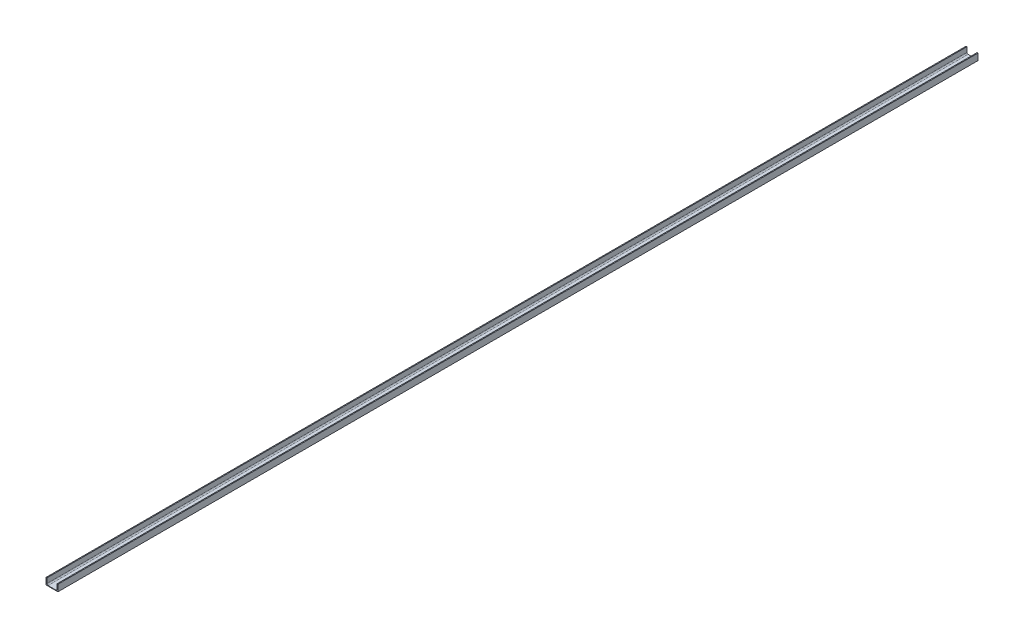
ISO-10303-21;
HEADER;
FILE_DESCRIPTION(('STEP AP214'),'2;1');
FILE_NAME('part.step','',(''),(''),'','','');
FILE_SCHEMA(('AUTOMOTIVE_DESIGN { 1 0 10303 214 1 1 1 1 }'));
ENDSEC;
DATA;
#1=APPLICATION_CONTEXT('core data for automotive mechanical design processes');
#2=APPLICATION_PROTOCOL_DEFINITION('international standard','automotive_design',2000,#1);
#3=PRODUCT_CONTEXT('',#1,'mechanical');
#4=PRODUCT('Part','Part','',(#3));
#5=PRODUCT_RELATED_PRODUCT_CATEGORY('part','',(#4));
#6=PRODUCT_DEFINITION_FORMATION('','',#4);
#7=PRODUCT_DEFINITION_CONTEXT('part definition',#1,'design');
#8=PRODUCT_DEFINITION('design','',#6,#7);
#9=PRODUCT_DEFINITION_SHAPE('','',#8);
#10=(LENGTH_UNIT() NAMED_UNIT(*) SI_UNIT(.MILLI.,.METRE.));
#11=(NAMED_UNIT(*) PLANE_ANGLE_UNIT() SI_UNIT($,.RADIAN.));
#12=(NAMED_UNIT(*) SI_UNIT($,.STERADIAN.) SOLID_ANGLE_UNIT());
#13=UNCERTAINTY_MEASURE_WITH_UNIT(LENGTH_MEASURE(1.E-05),#10,'distance_accuracy_value','');
#14=(GEOMETRIC_REPRESENTATION_CONTEXT(3) GLOBAL_UNCERTAINTY_ASSIGNED_CONTEXT((#13)) GLOBAL_UNIT_ASSIGNED_CONTEXT((#10,
#11,#12)) REPRESENTATION_CONTEXT('',''));
#15=CARTESIAN_POINT('',(0.,0.,0.));
#16=DIRECTION('',(0.,0.,1.));
#17=DIRECTION('',(1.,0.,0.));
#18=AXIS2_PLACEMENT_3D('',#15,#16,#17);
#19=CARTESIAN_POINT('',(0.,0.,7710.));
#20=DIRECTION('',(0.,1.,0.));
#21=DIRECTION('',(0.,0.,1.));
#22=AXIS2_PLACEMENT_3D('',#19,#20,#21);
#23=PLANE('',#22);
#24=CARTESIAN_POINT('',(69.9999999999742,0.,7560.));
#25=DIRECTION('',(0.,-1.,0.));
#26=DIRECTION('',(0.,0.,-1.));
#27=AXIS2_PLACEMENT_3D('',#24,#25,#26);
#28=CIRCLE('',#27,7.5000000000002);
#29=CARTESIAN_POINT('',(69.9999999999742,0.,7552.5));
#30=VERTEX_POINT('',#29);
#31=EDGE_CURVE('E271',#30,#30,#28,.T.);
#32=ORIENTED_EDGE('',*,*,#31,.F.);
#33=EDGE_LOOP('',(#32));
#34=FACE_BOUND('',#33,.T.);
#35=CARTESIAN_POINT('',(69.9999999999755,0.,7170.));
#36=DIRECTION('',(0.,-1.,0.));
#37=DIRECTION('',(0.,0.,-1.));
#38=AXIS2_PLACEMENT_3D('',#35,#36,#37);
#39=CIRCLE('',#38,7.5000000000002);
#40=CARTESIAN_POINT('',(69.9999999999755,0.,7162.5));
#41=VERTEX_POINT('',#40);
#42=EDGE_CURVE('E261',#41,#41,#39,.T.);
#43=ORIENTED_EDGE('',*,*,#42,.F.);
#44=EDGE_LOOP('',(#43));
#45=FACE_BOUND('',#44,.T.);
#46=CARTESIAN_POINT('',(69.9999999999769,0.,6780.));
#47=DIRECTION('',(0.,-1.,0.));
#48=DIRECTION('',(0.,0.,-1.));
#49=AXIS2_PLACEMENT_3D('',#46,#47,#48);
#50=CIRCLE('',#49,7.5000000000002);
#51=CARTESIAN_POINT('',(69.9999999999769,0.,6772.5));
#52=VERTEX_POINT('',#51);
#53=EDGE_CURVE('E258',#52,#52,#50,.T.);
#54=ORIENTED_EDGE('',*,*,#53,.F.);
#55=EDGE_LOOP('',(#54));
#56=FACE_BOUND('',#55,.T.);
#57=CARTESIAN_POINT('',(69.9999999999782,0.,6390.));
#58=DIRECTION('',(0.,-1.,0.));
#59=DIRECTION('',(0.,0.,-1.));
#60=AXIS2_PLACEMENT_3D('',#57,#58,#59);
#61=CIRCLE('',#60,7.5000000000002);
#62=CARTESIAN_POINT('',(69.9999999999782,0.,6382.5));
#63=VERTEX_POINT('',#62);
#64=EDGE_CURVE('E255',#63,#63,#61,.T.);
#65=ORIENTED_EDGE('',*,*,#64,.F.);
#66=EDGE_LOOP('',(#65));
#67=FACE_BOUND('',#66,.T.);
#68=CARTESIAN_POINT('',(69.9999999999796,0.,6000.));
#69=DIRECTION('',(0.,-1.,0.));
#70=DIRECTION('',(0.,0.,-1.));
#71=AXIS2_PLACEMENT_3D('',#68,#69,#70);
#72=CIRCLE('',#71,7.5000000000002);
#73=CARTESIAN_POINT('',(69.9999999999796,0.,5992.5));
#74=VERTEX_POINT('',#73);
#75=EDGE_CURVE('E251',#74,#74,#72,.T.);
#76=ORIENTED_EDGE('',*,*,#75,.F.);
#77=EDGE_LOOP('',(#76));
#78=FACE_BOUND('',#77,.T.);
#79=CARTESIAN_POINT('',(69.999999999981,0.,5610.));
#80=DIRECTION('',(0.,-1.,0.));
#81=DIRECTION('',(0.,0.,-1.));
#82=AXIS2_PLACEMENT_3D('',#79,#80,#81);
#83=CIRCLE('',#82,7.5000000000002);
#84=CARTESIAN_POINT('',(69.999999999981,0.,5602.5));
#85=VERTEX_POINT('',#84);
#86=EDGE_CURVE('E247',#85,#85,#83,.T.);
#87=ORIENTED_EDGE('',*,*,#86,.F.);
#88=EDGE_LOOP('',(#87));
#89=FACE_BOUND('',#88,.T.);
#90=CARTESIAN_POINT('',(69.9999999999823,0.,5220.));
#91=DIRECTION('',(0.,-1.,0.));
#92=DIRECTION('',(0.,0.,-1.));
#93=AXIS2_PLACEMENT_3D('',#90,#91,#92);
#94=CIRCLE('',#93,7.5000000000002);
#95=CARTESIAN_POINT('',(69.9999999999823,0.,5212.5));
#96=VERTEX_POINT('',#95);
#97=EDGE_CURVE('E243',#96,#96,#94,.T.);
#98=ORIENTED_EDGE('',*,*,#97,.F.);
#99=EDGE_LOOP('',(#98));
#100=FACE_BOUND('',#99,.T.);
#101=CARTESIAN_POINT('',(69.9999999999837,0.,4830.));
#102=DIRECTION('',(0.,-1.,0.));
#103=DIRECTION('',(0.,0.,-1.));
#104=AXIS2_PLACEMENT_3D('',#101,#102,#103);
#105=CIRCLE('',#104,7.5000000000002);
#106=CARTESIAN_POINT('',(69.9999999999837,0.,4822.5));
#107=VERTEX_POINT('',#106);
#108=EDGE_CURVE('E239',#107,#107,#105,.T.);
#109=ORIENTED_EDGE('',*,*,#108,.F.);
#110=EDGE_LOOP('',(#109));
#111=FACE_BOUND('',#110,.T.);
#112=CARTESIAN_POINT('',(69.9999999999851,0.,4440.));
#113=DIRECTION('',(0.,-1.,0.));
#114=DIRECTION('',(0.,0.,-1.));
#115=AXIS2_PLACEMENT_3D('',#112,#113,#114);
#116=CIRCLE('',#115,7.5000000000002);
#117=CARTESIAN_POINT('',(69.9999999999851,0.,4432.5));
#118=VERTEX_POINT('',#117);
#119=EDGE_CURVE('E235',#118,#118,#116,.T.);
#120=ORIENTED_EDGE('',*,*,#119,.F.);
#121=EDGE_LOOP('',(#120));
#122=FACE_BOUND('',#121,.T.);
#123=CARTESIAN_POINT('',(69.9999999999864,0.,4050.));
#124=DIRECTION('',(0.,-1.,0.));
#125=DIRECTION('',(0.,0.,-1.));
#126=AXIS2_PLACEMENT_3D('',#123,#124,#125);
#127=CIRCLE('',#126,7.50000000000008);
#128=CARTESIAN_POINT('',(69.9999999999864,0.,4042.5));
#129=VERTEX_POINT('',#128);
#130=EDGE_CURVE('E231',#129,#129,#127,.T.);
#131=ORIENTED_EDGE('',*,*,#130,.F.);
#132=EDGE_LOOP('',(#131));
#133=FACE_BOUND('',#132,.T.);
#134=CARTESIAN_POINT('',(69.9999999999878,0.,3660.));
#135=DIRECTION('',(0.,-1.,0.));
#136=DIRECTION('',(0.,0.,-1.));
#137=AXIS2_PLACEMENT_3D('',#134,#135,#136);
#138=CIRCLE('',#137,7.49999999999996);
#139=CARTESIAN_POINT('',(69.9999999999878,0.,3652.5));
#140=VERTEX_POINT('',#139);
#141=EDGE_CURVE('E227',#140,#140,#138,.T.);
#142=ORIENTED_EDGE('',*,*,#141,.F.);
#143=EDGE_LOOP('',(#142));
#144=FACE_BOUND('',#143,.T.);
#145=CARTESIAN_POINT('',(69.9999999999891,0.,3270.));
#146=DIRECTION('',(0.,-1.,0.));
#147=DIRECTION('',(0.,0.,-1.));
#148=AXIS2_PLACEMENT_3D('',#145,#146,#147);
#149=CIRCLE('',#148,7.49999999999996);
#150=CARTESIAN_POINT('',(69.9999999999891,0.,3262.5));
#151=VERTEX_POINT('',#150);
#152=EDGE_CURVE('E223',#151,#151,#149,.T.);
#153=ORIENTED_EDGE('',*,*,#152,.F.);
#154=EDGE_LOOP('',(#153));
#155=FACE_BOUND('',#154,.T.);
#156=CARTESIAN_POINT('',(69.9999999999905,0.,2880.));
#157=DIRECTION('',(0.,-1.,0.));
#158=DIRECTION('',(0.,0.,-1.));
#159=AXIS2_PLACEMENT_3D('',#156,#157,#158);
#160=CIRCLE('',#159,7.49999999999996);
#161=CARTESIAN_POINT('',(69.9999999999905,0.,2872.5));
#162=VERTEX_POINT('',#161);
#163=EDGE_CURVE('E219',#162,#162,#160,.T.);
#164=ORIENTED_EDGE('',*,*,#163,.F.);
#165=EDGE_LOOP('',(#164));
#166=FACE_BOUND('',#165,.T.);
#167=CARTESIAN_POINT('',(69.9999999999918,0.,2490.));
#168=DIRECTION('',(0.,-1.,0.));
#169=DIRECTION('',(0.,0.,-1.));
#170=AXIS2_PLACEMENT_3D('',#167,#168,#169);
#171=CIRCLE('',#170,7.49999999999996);
#172=CARTESIAN_POINT('',(69.9999999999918,0.,2482.5));
#173=VERTEX_POINT('',#172);
#174=EDGE_CURVE('E215',#173,#173,#171,.T.);
#175=ORIENTED_EDGE('',*,*,#174,.F.);
#176=EDGE_LOOP('',(#175));
#177=FACE_BOUND('',#176,.T.);
#178=CARTESIAN_POINT('',(69.9999999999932,0.,2100.));
#179=DIRECTION('',(0.,-1.,0.));
#180=DIRECTION('',(0.,0.,-1.));
#181=AXIS2_PLACEMENT_3D('',#178,#179,#180);
#182=CIRCLE('',#181,7.49999999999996);
#183=CARTESIAN_POINT('',(69.9999999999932,0.,2092.5));
#184=VERTEX_POINT('',#183);
#185=EDGE_CURVE('E211',#184,#184,#182,.T.);
#186=ORIENTED_EDGE('',*,*,#185,.F.);
#187=EDGE_LOOP('',(#186));
#188=FACE_BOUND('',#187,.T.);
#189=CARTESIAN_POINT('',(69.9999999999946,0.,1710.));
#190=DIRECTION('',(0.,-1.,0.));
#191=DIRECTION('',(0.,0.,-1.));
#192=AXIS2_PLACEMENT_3D('',#189,#190,#191);
#193=CIRCLE('',#192,7.49999999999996);
#194=CARTESIAN_POINT('',(69.9999999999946,0.,1702.5));
#195=VERTEX_POINT('',#194);
#196=EDGE_CURVE('E207',#195,#195,#193,.T.);
#197=ORIENTED_EDGE('',*,*,#196,.F.);
#198=EDGE_LOOP('',(#197));
#199=FACE_BOUND('',#198,.T.);
#200=CARTESIAN_POINT('',(69.9999999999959,0.,1320.));
#201=DIRECTION('',(0.,-1.,0.));
#202=DIRECTION('',(0.,0.,-1.));
#203=AXIS2_PLACEMENT_3D('',#200,#201,#202);
#204=CIRCLE('',#203,7.49999999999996);
#205=CARTESIAN_POINT('',(69.9999999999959,0.,1312.5));
#206=VERTEX_POINT('',#205);
#207=EDGE_CURVE('E203',#206,#206,#204,.T.);
#208=ORIENTED_EDGE('',*,*,#207,.F.);
#209=EDGE_LOOP('',(#208));
#210=FACE_BOUND('',#209,.T.);
#211=CARTESIAN_POINT('',(69.9999999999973,0.,930.));
#212=DIRECTION('',(0.,-1.,0.));
#213=DIRECTION('',(0.,0.,-1.));
#214=AXIS2_PLACEMENT_3D('',#211,#212,#213);
#215=CIRCLE('',#214,7.50000000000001);
#216=CARTESIAN_POINT('',(69.9999999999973,0.,922.5));
#217=VERTEX_POINT('',#216);
#218=EDGE_CURVE('E199',#217,#217,#215,.T.);
#219=ORIENTED_EDGE('',*,*,#218,.F.);
#220=EDGE_LOOP('',(#219));
#221=FACE_BOUND('',#220,.T.);
#222=CARTESIAN_POINT('',(69.9999999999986,0.,540.));
#223=DIRECTION('',(0.,-1.,0.));
#224=DIRECTION('',(0.,0.,-1.));
#225=AXIS2_PLACEMENT_3D('',#222,#223,#224);
#226=CIRCLE('',#225,7.50000000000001);
#227=CARTESIAN_POINT('',(69.9999999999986,0.,532.5));
#228=VERTEX_POINT('',#227);
#229=EDGE_CURVE('E195',#228,#228,#226,.T.);
#230=ORIENTED_EDGE('',*,*,#229,.F.);
#231=EDGE_LOOP('',(#230));
#232=FACE_BOUND('',#231,.T.);
#233=CARTESIAN_POINT('',(70.,0.,150.));
#234=DIRECTION('',(0.,-1.,0.));
#235=DIRECTION('',(0.,0.,-1.));
#236=AXIS2_PLACEMENT_3D('',#233,#234,#235);
#237=CIRCLE('',#236,7.50000000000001);
#238=CARTESIAN_POINT('',(70.,0.,142.5));
#239=VERTEX_POINT('',#238);
#240=EDGE_CURVE('E131',#239,#239,#237,.T.);
#241=ORIENTED_EDGE('',*,*,#240,.F.);
#242=EDGE_LOOP('',(#241));
#243=FACE_BOUND('',#242,.T.);
#244=DIRECTION('',(1.,0.,0.));
#245=VECTOR('',#244,1.);
#246=CARTESIAN_POINT('',(0.,0.,0.));
#247=LINE('',#246,#245);
#248=CARTESIAN_POINT('',(0.,0.,0.));
#249=VERTEX_POINT('',#248);
#250=CARTESIAN_POINT('',(100.,0.,0.));
#251=VERTEX_POINT('',#250);
#252=EDGE_CURVE('E116',#249,#251,#247,.T.);
#253=ORIENTED_EDGE('',*,*,#252,.T.);
#254=DIRECTION('',(0.,0.,-1.));
#255=VECTOR('',#254,1.);
#256=CARTESIAN_POINT('',(100.,0.,7710.));
#257=LINE('',#256,#255);
#258=CARTESIAN_POINT('',(100.,0.,7710.));
#259=VERTEX_POINT('',#258);
#260=EDGE_CURVE('E11',#259,#251,#257,.T.);
#261=ORIENTED_EDGE('',*,*,#260,.F.);
#262=DIRECTION('',(1.,0.,0.));
#263=VECTOR('',#262,1.);
#264=CARTESIAN_POINT('',(0.,0.,7710.));
#265=LINE('',#264,#263);
#266=CARTESIAN_POINT('',(0.,0.,7710.));
#267=VERTEX_POINT('',#266);
#268=EDGE_CURVE('E153',#267,#259,#265,.T.);
#269=ORIENTED_EDGE('',*,*,#268,.F.);
#270=DIRECTION('',(0.,0.,-1.));
#271=VECTOR('',#270,1.);
#272=CARTESIAN_POINT('',(0.,0.,7710.));
#273=LINE('',#272,#271);
#274=EDGE_CURVE('E48',#267,#249,#273,.T.);
#275=ORIENTED_EDGE('',*,*,#274,.T.);
#276=EDGE_LOOP('',(#253,#261,#269,#275));
#277=FACE_BOUND('',#276,.T.);
#278=ADVANCED_FACE('F32',(#34,#45,#56,#67,#78,#89,#100,#111,#122,#133,#144,#155,#166,#177,#188,
#199,#210,#221,#232,#243,#277),#23,.F.);
#279=CARTESIAN_POINT('',(100.,0.,7710.));
#280=DIRECTION('',(-1.,0.,0.));
#281=DIRECTION('',(0.,0.,1.));
#282=AXIS2_PLACEMENT_3D('',#279,#280,#281);
#283=PLANE('',#282);
#284=DIRECTION('',(0.,1.,0.));
#285=VECTOR('',#284,1.);
#286=CARTESIAN_POINT('',(100.,0.,0.));
#287=LINE('',#286,#285);
#288=CARTESIAN_POINT('',(100.,55.,0.));
#289=VERTEX_POINT('',#288);
#290=EDGE_CURVE('E112',#251,#289,#287,.T.);
#291=ORIENTED_EDGE('',*,*,#290,.T.);
#292=DIRECTION('',(0.,0.,-1.));
#293=VECTOR('',#292,1.);
#294=CARTESIAN_POINT('',(100.,55.,7710.));
#295=LINE('',#294,#293);
#296=CARTESIAN_POINT('',(100.,55.,7710.));
#297=VERTEX_POINT('',#296);
#298=EDGE_CURVE('E40',#297,#289,#295,.T.);
#299=ORIENTED_EDGE('',*,*,#298,.F.);
#300=DIRECTION('',(0.,1.,0.));
#301=VECTOR('',#300,1.);
#302=CARTESIAN_POINT('',(100.,0.,7710.));
#303=LINE('',#302,#301);
#304=EDGE_CURVE('E125',#259,#297,#303,.T.);
#305=ORIENTED_EDGE('',*,*,#304,.F.);
#306=ORIENTED_EDGE('',*,*,#260,.T.);
#307=EDGE_LOOP('',(#291,#299,#305,#306));
#308=FACE_BOUND('',#307,.T.);
#309=ADVANCED_FACE('F124',(#308),#283,.F.);
#310=CARTESIAN_POINT('',(100.,55.,7710.));
#311=DIRECTION('',(0.,-1.,0.));
#312=DIRECTION('',(0.,0.,-1.));
#313=AXIS2_PLACEMENT_3D('',#310,#311,#312);
#314=PLANE('',#313);
#315=DIRECTION('',(-1.,0.,0.));
#316=VECTOR('',#315,1.);
#317=CARTESIAN_POINT('',(100.,55.,0.));
#318=LINE('',#317,#316);
#319=CARTESIAN_POINT('',(92.5,55.,0.));
#320=VERTEX_POINT('',#319);
#321=EDGE_CURVE('E118',#289,#320,#318,.T.);
#322=ORIENTED_EDGE('',*,*,#321,.T.);
#323=DIRECTION('',(0.,0.,-1.));
#324=VECTOR('',#323,1.);
#325=CARTESIAN_POINT('',(92.5,55.,7710.));
#326=LINE('',#325,#324);
#327=CARTESIAN_POINT('',(92.5,55.,7710.));
#328=VERTEX_POINT('',#327);
#329=EDGE_CURVE('E188',#328,#320,#326,.T.);
#330=ORIENTED_EDGE('',*,*,#329,.F.);
#331=DIRECTION('',(-1.,0.,0.));
#332=VECTOR('',#331,1.);
#333=CARTESIAN_POINT('',(100.,55.,7710.));
#334=LINE('',#333,#332);
#335=EDGE_CURVE('E156',#297,#328,#334,.T.);
#336=ORIENTED_EDGE('',*,*,#335,.F.);
#337=ORIENTED_EDGE('',*,*,#298,.T.);
#338=EDGE_LOOP('',(#322,#330,#336,#337));
#339=FACE_BOUND('',#338,.T.);
#340=ADVANCED_FACE('F354',(#339),#314,.F.);
#341=CARTESIAN_POINT('',(92.5,55.,7710.));
#342=DIRECTION('',(1.,0.,0.));
#343=DIRECTION('',(0.,0.,-1.));
#344=AXIS2_PLACEMENT_3D('',#341,#342,#343);
#345=PLANE('',#344);
#346=DIRECTION('',(0.,-1.,0.));
#347=VECTOR('',#346,1.);
#348=CARTESIAN_POINT('',(92.5,55.,0.));
#349=LINE('',#348,#347);
#350=CARTESIAN_POINT('',(92.5,14.5000000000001,0.));
#351=VERTEX_POINT('',#350);
#352=EDGE_CURVE('E137',#320,#351,#349,.T.);
#353=ORIENTED_EDGE('',*,*,#352,.T.);
#354=DIRECTION('',(0.,0.,-1.));
#355=VECTOR('',#354,1.);
#356=CARTESIAN_POINT('',(92.5,14.5000000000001,7710.));
#357=LINE('',#356,#355);
#358=CARTESIAN_POINT('',(92.5,14.5000000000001,7710.));
#359=VERTEX_POINT('',#358);
#360=EDGE_CURVE('E185',#359,#351,#357,.T.);
#361=ORIENTED_EDGE('',*,*,#360,.F.);
#362=DIRECTION('',(0.,-1.,0.));
#363=VECTOR('',#362,1.);
#364=CARTESIAN_POINT('',(92.5,55.,7710.));
#365=LINE('',#364,#363);
#366=EDGE_CURVE('E158',#328,#359,#365,.T.);
#367=ORIENTED_EDGE('',*,*,#366,.F.);
#368=ORIENTED_EDGE('',*,*,#329,.T.);
#369=EDGE_LOOP('',(#353,#361,#367,#368));
#370=FACE_BOUND('',#369,.T.);
#371=ADVANCED_FACE('F350',(#370),#345,.F.);
#372=CARTESIAN_POINT('',(82.5,14.5,7710.));
#373=DIRECTION('',(0.,0.,-1.));
#374=DIRECTION('',(-1.,0.,0.));
#375=AXIS2_PLACEMENT_3D('',#372,#373,#374);
#376=CYLINDRICAL_SURFACE('',#375,10.);
#377=CARTESIAN_POINT('',(82.5,14.5,0.));
#378=DIRECTION('',(0.,0.,-1.));
#379=DIRECTION('',(-1.,0.,0.));
#380=AXIS2_PLACEMENT_3D('',#377,#378,#379);
#381=CIRCLE('',#380,10.);
#382=CARTESIAN_POINT('',(82.4999999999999,4.5,0.));
#383=VERTEX_POINT('',#382);
#384=EDGE_CURVE('E139',#351,#383,#381,.T.);
#385=ORIENTED_EDGE('',*,*,#384,.T.);
#386=DIRECTION('',(0.,0.,-1.));
#387=VECTOR('',#386,1.);
#388=CARTESIAN_POINT('',(82.4999999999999,4.5,7710.));
#389=LINE('',#388,#387);
#390=CARTESIAN_POINT('',(82.4999999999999,4.5,7710.));
#391=VERTEX_POINT('',#390);
#392=EDGE_CURVE('E182',#391,#383,#389,.T.);
#393=ORIENTED_EDGE('',*,*,#392,.F.);
#394=CARTESIAN_POINT('',(82.5,14.5,7710.));
#395=DIRECTION('',(0.,0.,-1.));
#396=DIRECTION('',(-1.,0.,0.));
#397=AXIS2_PLACEMENT_3D('',#394,#395,#396);
#398=CIRCLE('',#397,10.);
#399=EDGE_CURVE('E160',#359,#391,#398,.T.);
#400=ORIENTED_EDGE('',*,*,#399,.F.);
#401=ORIENTED_EDGE('',*,*,#360,.T.);
#402=EDGE_LOOP('',(#385,#393,#400,#401));
#403=FACE_BOUND('',#402,.T.);
#404=ADVANCED_FACE('F325',(#403),#376,.F.);
#405=CARTESIAN_POINT('',(82.4999999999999,4.5,7710.));
#406=DIRECTION('',(0.,-1.,0.));
#407=DIRECTION('',(1.,0.,0.));
#408=AXIS2_PLACEMENT_3D('',#405,#406,#407);
#409=PLANE('',#408);
#410=CARTESIAN_POINT('',(69.9999999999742,4.5,7560.));
#411=DIRECTION('',(0.,-1.,0.));
#412=DIRECTION('',(1.,0.,0.));
#413=AXIS2_PLACEMENT_3D('',#410,#411,#412);
#414=CIRCLE('',#413,7.5000000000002);
#415=CARTESIAN_POINT('',(77.4999999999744,4.5,7560.));
#416=VERTEX_POINT('',#415);
#417=EDGE_CURVE('E35',#416,#416,#414,.T.);
#418=ORIENTED_EDGE('',*,*,#417,.T.);
#419=EDGE_LOOP('',(#418));
#420=FACE_BOUND('',#419,.T.);
#421=CARTESIAN_POINT('',(69.9999999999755,4.5,7170.));
#422=DIRECTION('',(0.,-1.,0.));
#423=DIRECTION('',(1.,0.,0.));
#424=AXIS2_PLACEMENT_3D('',#421,#422,#423);
#425=CIRCLE('',#424,7.5000000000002);
#426=CARTESIAN_POINT('',(77.4999999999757,4.5,7170.));
#427=VERTEX_POINT('',#426);
#428=EDGE_CURVE('E259',#427,#427,#425,.T.);
#429=ORIENTED_EDGE('',*,*,#428,.T.);
#430=EDGE_LOOP('',(#429));
#431=FACE_BOUND('',#430,.T.);
#432=CARTESIAN_POINT('',(69.9999999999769,4.5,6780.));
#433=DIRECTION('',(0.,-1.,0.));
#434=DIRECTION('',(1.,0.,0.));
#435=AXIS2_PLACEMENT_3D('',#432,#433,#434);
#436=CIRCLE('',#435,7.5000000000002);
#437=CARTESIAN_POINT('',(77.4999999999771,4.5,6780.));
#438=VERTEX_POINT('',#437);
#439=EDGE_CURVE('E256',#438,#438,#436,.T.);
#440=ORIENTED_EDGE('',*,*,#439,.T.);
#441=EDGE_LOOP('',(#440));
#442=FACE_BOUND('',#441,.T.);
#443=CARTESIAN_POINT('',(69.9999999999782,4.5,6390.));
#444=DIRECTION('',(0.,-1.,0.));
#445=DIRECTION('',(1.,0.,0.));
#446=AXIS2_PLACEMENT_3D('',#443,#444,#445);
#447=CIRCLE('',#446,7.5000000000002);
#448=CARTESIAN_POINT('',(77.4999999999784,4.5,6390.));
#449=VERTEX_POINT('',#448);
#450=EDGE_CURVE('E252',#449,#449,#447,.T.);
#451=ORIENTED_EDGE('',*,*,#450,.T.);
#452=EDGE_LOOP('',(#451));
#453=FACE_BOUND('',#452,.T.);
#454=CARTESIAN_POINT('',(69.9999999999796,4.5,6000.));
#455=DIRECTION('',(0.,-1.,0.));
#456=DIRECTION('',(1.,0.,0.));
#457=AXIS2_PLACEMENT_3D('',#454,#455,#456);
#458=CIRCLE('',#457,7.5000000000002);
#459=CARTESIAN_POINT('',(77.4999999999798,4.5,6000.));
#460=VERTEX_POINT('',#459);
#461=EDGE_CURVE('E248',#460,#460,#458,.T.);
#462=ORIENTED_EDGE('',*,*,#461,.T.);
#463=EDGE_LOOP('',(#462));
#464=FACE_BOUND('',#463,.T.);
#465=CARTESIAN_POINT('',(69.999999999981,4.5,5610.));
#466=DIRECTION('',(0.,-1.,0.));
#467=DIRECTION('',(1.,0.,0.));
#468=AXIS2_PLACEMENT_3D('',#465,#466,#467);
#469=CIRCLE('',#468,7.5000000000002);
#470=CARTESIAN_POINT('',(77.4999999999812,4.5,5610.));
#471=VERTEX_POINT('',#470);
#472=EDGE_CURVE('E244',#471,#471,#469,.T.);
#473=ORIENTED_EDGE('',*,*,#472,.T.);
#474=EDGE_LOOP('',(#473));
#475=FACE_BOUND('',#474,.T.);
#476=CARTESIAN_POINT('',(69.9999999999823,4.5,5220.));
#477=DIRECTION('',(0.,-1.,0.));
#478=DIRECTION('',(1.,0.,0.));
#479=AXIS2_PLACEMENT_3D('',#476,#477,#478);
#480=CIRCLE('',#479,7.5000000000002);
#481=CARTESIAN_POINT('',(77.4999999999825,4.5,5220.));
#482=VERTEX_POINT('',#481);
#483=EDGE_CURVE('E240',#482,#482,#480,.T.);
#484=ORIENTED_EDGE('',*,*,#483,.T.);
#485=EDGE_LOOP('',(#484));
#486=FACE_BOUND('',#485,.T.);
#487=CARTESIAN_POINT('',(69.9999999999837,4.5,4830.));
#488=DIRECTION('',(0.,-1.,0.));
#489=DIRECTION('',(1.,0.,0.));
#490=AXIS2_PLACEMENT_3D('',#487,#488,#489);
#491=CIRCLE('',#490,7.5000000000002);
#492=CARTESIAN_POINT('',(77.4999999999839,4.5,4830.));
#493=VERTEX_POINT('',#492);
#494=EDGE_CURVE('E236',#493,#493,#491,.T.);
#495=ORIENTED_EDGE('',*,*,#494,.T.);
#496=EDGE_LOOP('',(#495));
#497=FACE_BOUND('',#496,.T.);
#498=CARTESIAN_POINT('',(69.9999999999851,4.5,4440.));
#499=DIRECTION('',(0.,-1.,0.));
#500=DIRECTION('',(1.,0.,0.));
#501=AXIS2_PLACEMENT_3D('',#498,#499,#500);
#502=CIRCLE('',#501,7.5000000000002);
#503=CARTESIAN_POINT('',(77.4999999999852,4.5,4440.));
#504=VERTEX_POINT('',#503);
#505=EDGE_CURVE('E232',#504,#504,#502,.T.);
#506=ORIENTED_EDGE('',*,*,#505,.T.);
#507=EDGE_LOOP('',(#506));
#508=FACE_BOUND('',#507,.T.);
#509=CARTESIAN_POINT('',(69.9999999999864,4.5,4050.));
#510=DIRECTION('',(0.,-1.,0.));
#511=DIRECTION('',(1.,0.,0.));
#512=AXIS2_PLACEMENT_3D('',#509,#510,#511);
#513=CIRCLE('',#512,7.50000000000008);
#514=CARTESIAN_POINT('',(77.4999999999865,4.5,4050.));
#515=VERTEX_POINT('',#514);
#516=EDGE_CURVE('E228',#515,#515,#513,.T.);
#517=ORIENTED_EDGE('',*,*,#516,.T.);
#518=EDGE_LOOP('',(#517));
#519=FACE_BOUND('',#518,.T.);
#520=CARTESIAN_POINT('',(69.9999999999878,4.5,3660.));
#521=DIRECTION('',(0.,-1.,0.));
#522=DIRECTION('',(1.,0.,0.));
#523=AXIS2_PLACEMENT_3D('',#520,#521,#522);
#524=CIRCLE('',#523,7.49999999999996);
#525=CARTESIAN_POINT('',(77.4999999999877,4.5,3660.));
#526=VERTEX_POINT('',#525);
#527=EDGE_CURVE('E224',#526,#526,#524,.T.);
#528=ORIENTED_EDGE('',*,*,#527,.T.);
#529=EDGE_LOOP('',(#528));
#530=FACE_BOUND('',#529,.T.);
#531=CARTESIAN_POINT('',(69.9999999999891,4.5,3270.));
#532=DIRECTION('',(0.,-1.,0.));
#533=DIRECTION('',(1.,0.,0.));
#534=AXIS2_PLACEMENT_3D('',#531,#532,#533);
#535=CIRCLE('',#534,7.49999999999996);
#536=CARTESIAN_POINT('',(77.4999999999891,4.5,3270.));
#537=VERTEX_POINT('',#536);
#538=EDGE_CURVE('E220',#537,#537,#535,.T.);
#539=ORIENTED_EDGE('',*,*,#538,.T.);
#540=EDGE_LOOP('',(#539));
#541=FACE_BOUND('',#540,.T.);
#542=CARTESIAN_POINT('',(69.9999999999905,4.5,2880.));
#543=DIRECTION('',(0.,-1.,0.));
#544=DIRECTION('',(1.,0.,0.));
#545=AXIS2_PLACEMENT_3D('',#542,#543,#544);
#546=CIRCLE('',#545,7.49999999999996);
#547=CARTESIAN_POINT('',(77.4999999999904,4.5,2880.));
#548=VERTEX_POINT('',#547);
#549=EDGE_CURVE('E216',#548,#548,#546,.T.);
#550=ORIENTED_EDGE('',*,*,#549,.T.);
#551=EDGE_LOOP('',(#550));
#552=FACE_BOUND('',#551,.T.);
#553=CARTESIAN_POINT('',(69.9999999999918,4.5,2490.));
#554=DIRECTION('',(0.,-1.,0.));
#555=DIRECTION('',(1.,0.,0.));
#556=AXIS2_PLACEMENT_3D('',#553,#554,#555);
#557=CIRCLE('',#556,7.49999999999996);
#558=CARTESIAN_POINT('',(77.4999999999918,4.5,2490.));
#559=VERTEX_POINT('',#558);
#560=EDGE_CURVE('E212',#559,#559,#557,.T.);
#561=ORIENTED_EDGE('',*,*,#560,.T.);
#562=EDGE_LOOP('',(#561));
#563=FACE_BOUND('',#562,.T.);
#564=CARTESIAN_POINT('',(69.9999999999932,4.5,2100.));
#565=DIRECTION('',(0.,-1.,0.));
#566=DIRECTION('',(1.,0.,0.));
#567=AXIS2_PLACEMENT_3D('',#564,#565,#566);
#568=CIRCLE('',#567,7.49999999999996);
#569=CARTESIAN_POINT('',(77.4999999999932,4.5,2100.));
#570=VERTEX_POINT('',#569);
#571=EDGE_CURVE('E208',#570,#570,#568,.T.);
#572=ORIENTED_EDGE('',*,*,#571,.T.);
#573=EDGE_LOOP('',(#572));
#574=FACE_BOUND('',#573,.T.);
#575=CARTESIAN_POINT('',(69.9999999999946,4.5,1710.));
#576=DIRECTION('',(0.,-1.,0.));
#577=DIRECTION('',(1.,0.,0.));
#578=AXIS2_PLACEMENT_3D('',#575,#576,#577);
#579=CIRCLE('',#578,7.49999999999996);
#580=CARTESIAN_POINT('',(77.4999999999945,4.5,1710.));
#581=VERTEX_POINT('',#580);
#582=EDGE_CURVE('E204',#581,#581,#579,.T.);
#583=ORIENTED_EDGE('',*,*,#582,.T.);
#584=EDGE_LOOP('',(#583));
#585=FACE_BOUND('',#584,.T.);
#586=CARTESIAN_POINT('',(69.9999999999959,4.5,1320.));
#587=DIRECTION('',(0.,-1.,0.));
#588=DIRECTION('',(1.,0.,0.));
#589=AXIS2_PLACEMENT_3D('',#586,#587,#588);
#590=CIRCLE('',#589,7.49999999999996);
#591=CARTESIAN_POINT('',(77.4999999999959,4.5,1320.));
#592=VERTEX_POINT('',#591);
#593=EDGE_CURVE('E200',#592,#592,#590,.T.);
#594=ORIENTED_EDGE('',*,*,#593,.T.);
#595=EDGE_LOOP('',(#594));
#596=FACE_BOUND('',#595,.T.);
#597=CARTESIAN_POINT('',(69.9999999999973,4.5,930.));
#598=DIRECTION('',(0.,-1.,0.));
#599=DIRECTION('',(1.,0.,0.));
#600=AXIS2_PLACEMENT_3D('',#597,#598,#599);
#601=CIRCLE('',#600,7.50000000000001);
#602=CARTESIAN_POINT('',(77.4999999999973,4.5,930.));
#603=VERTEX_POINT('',#602);
#604=EDGE_CURVE('E196',#603,#603,#601,.T.);
#605=ORIENTED_EDGE('',*,*,#604,.T.);
#606=EDGE_LOOP('',(#605));
#607=FACE_BOUND('',#606,.T.);
#608=CARTESIAN_POINT('',(69.9999999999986,4.5,540.));
#609=DIRECTION('',(0.,-1.,0.));
#610=DIRECTION('',(1.,0.,0.));
#611=AXIS2_PLACEMENT_3D('',#608,#609,#610);
#612=CIRCLE('',#611,7.50000000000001);
#613=CARTESIAN_POINT('',(77.4999999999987,4.5,540.));
#614=VERTEX_POINT('',#613);
#615=EDGE_CURVE('E192',#614,#614,#612,.T.);
#616=ORIENTED_EDGE('',*,*,#615,.T.);
#617=EDGE_LOOP('',(#616));
#618=FACE_BOUND('',#617,.T.);
#619=CARTESIAN_POINT('',(70.,4.5,150.));
#620=DIRECTION('',(0.,-1.,0.));
#621=DIRECTION('',(1.,0.,0.));
#622=AXIS2_PLACEMENT_3D('',#619,#620,#621);
#623=CIRCLE('',#622,7.50000000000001);
#624=CARTESIAN_POINT('',(77.5,4.5,150.));
#625=VERTEX_POINT('',#624);
#626=EDGE_CURVE('E128',#625,#625,#623,.T.);
#627=ORIENTED_EDGE('',*,*,#626,.T.);
#628=EDGE_LOOP('',(#627));
#629=FACE_BOUND('',#628,.T.);
#630=DIRECTION('',(-1.,0.,0.));
#631=VECTOR('',#630,1.);
#632=CARTESIAN_POINT('',(82.4999999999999,4.5,0.));
#633=LINE('',#632,#631);
#634=CARTESIAN_POINT('',(17.5000000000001,4.49999999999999,0.));
#635=VERTEX_POINT('',#634);
#636=EDGE_CURVE('E141',#383,#635,#633,.T.);
#637=ORIENTED_EDGE('',*,*,#636,.T.);
#638=DIRECTION('',(0.,0.,-1.));
#639=VECTOR('',#638,1.);
#640=CARTESIAN_POINT('',(17.5000000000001,4.49999999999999,7710.));
#641=LINE('',#640,#639);
#642=CARTESIAN_POINT('',(17.5000000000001,4.49999999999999,7710.));
#643=VERTEX_POINT('',#642);
#644=EDGE_CURVE('E179',#643,#635,#641,.T.);
#645=ORIENTED_EDGE('',*,*,#644,.F.);
#646=DIRECTION('',(-1.,0.,0.));
#647=VECTOR('',#646,1.);
#648=CARTESIAN_POINT('',(82.4999999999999,4.5,7710.));
#649=LINE('',#648,#647);
#650=EDGE_CURVE('E162',#391,#643,#649,.T.);
#651=ORIENTED_EDGE('',*,*,#650,.F.);
#652=ORIENTED_EDGE('',*,*,#392,.T.);
#653=EDGE_LOOP('',(#637,#645,#651,#652));
#654=FACE_BOUND('',#653,.T.);
#655=ADVANCED_FACE('F321',(#420,#431,#442,#453,#464,#475,#486,#497,#508,#519,#530,#541,#552,
#563,#574,#585,#596,#607,#618,#629,#654),#409,.F.);
#656=CARTESIAN_POINT('',(17.5,14.5,7710.));
#657=DIRECTION('',(0.,0.,-1.));
#658=DIRECTION('',(-1.,0.,0.));
#659=AXIS2_PLACEMENT_3D('',#656,#657,#658);
#660=CYLINDRICAL_SURFACE('',#659,10.);
#661=CARTESIAN_POINT('',(17.5,14.5,0.));
#662=DIRECTION('',(0.,0.,-1.));
#663=DIRECTION('',(-1.,0.,0.));
#664=AXIS2_PLACEMENT_3D('',#661,#662,#663);
#665=CIRCLE('',#664,10.);
#666=CARTESIAN_POINT('',(7.50000000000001,14.5000000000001,0.));
#667=VERTEX_POINT('',#666);
#668=EDGE_CURVE('E143',#635,#667,#665,.T.);
#669=ORIENTED_EDGE('',*,*,#668,.T.);
#670=DIRECTION('',(0.,0.,-1.));
#671=VECTOR('',#670,1.);
#672=CARTESIAN_POINT('',(7.50000000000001,14.5000000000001,7710.));
#673=LINE('',#672,#671);
#674=CARTESIAN_POINT('',(7.50000000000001,14.5000000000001,7710.));
#675=VERTEX_POINT('',#674);
#676=EDGE_CURVE('E176',#675,#667,#673,.T.);
#677=ORIENTED_EDGE('',*,*,#676,.F.);
#678=CARTESIAN_POINT('',(17.5,14.5,7710.));
#679=DIRECTION('',(0.,0.,-1.));
#680=DIRECTION('',(-1.,0.,0.));
#681=AXIS2_PLACEMENT_3D('',#678,#679,#680);
#682=CIRCLE('',#681,10.);
#683=EDGE_CURVE('E164',#643,#675,#682,.T.);
#684=ORIENTED_EDGE('',*,*,#683,.F.);
#685=ORIENTED_EDGE('',*,*,#644,.T.);
#686=EDGE_LOOP('',(#669,#677,#684,#685));
#687=FACE_BOUND('',#686,.T.);
#688=ADVANCED_FACE('F324',(#687),#660,.F.);
#689=CARTESIAN_POINT('',(7.50000000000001,14.5000000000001,7710.));
#690=DIRECTION('',(-1.,0.,0.));
#691=DIRECTION('',(0.,-1.,0.));
#692=AXIS2_PLACEMENT_3D('',#689,#690,#691);
#693=PLANE('',#692);
#694=DIRECTION('',(0.,1.,0.));
#695=VECTOR('',#694,1.);
#696=CARTESIAN_POINT('',(7.50000000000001,14.5000000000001,0.));
#697=LINE('',#696,#695);
#698=CARTESIAN_POINT('',(7.5,55.,0.));
#699=VERTEX_POINT('',#698);
#700=EDGE_CURVE('E145',#667,#699,#697,.T.);
#701=ORIENTED_EDGE('',*,*,#700,.T.);
#702=DIRECTION('',(0.,0.,-1.));
#703=VECTOR('',#702,1.);
#704=CARTESIAN_POINT('',(7.5,55.,7710.));
#705=LINE('',#704,#703);
#706=CARTESIAN_POINT('',(7.5,55.,7710.));
#707=VERTEX_POINT('',#706);
#708=EDGE_CURVE('E174',#707,#699,#705,.T.);
#709=ORIENTED_EDGE('',*,*,#708,.F.);
#710=DIRECTION('',(0.,1.,0.));
#711=VECTOR('',#710,1.);
#712=CARTESIAN_POINT('',(7.50000000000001,14.5000000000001,7710.));
#713=LINE('',#712,#711);
#714=EDGE_CURVE('E166',#675,#707,#713,.T.);
#715=ORIENTED_EDGE('',*,*,#714,.F.);
#716=ORIENTED_EDGE('',*,*,#676,.T.);
#717=EDGE_LOOP('',(#701,#709,#715,#716));
#718=FACE_BOUND('',#717,.T.);
#719=ADVANCED_FACE('F340',(#718),#693,.F.);
#720=CARTESIAN_POINT('',(0.,55.,7710.));
#721=DIRECTION('',(0.,1.,0.));
#722=DIRECTION('',(0.,0.,1.));
#723=AXIS2_PLACEMENT_3D('',#720,#721,#722);
#724=PLANE('',#723);
#725=DIRECTION('',(1.,0.,0.));
#726=VECTOR('',#725,1.);
#727=CARTESIAN_POINT('',(0.,55.,0.));
#728=LINE('',#727,#726);
#729=CARTESIAN_POINT('',(0.,55.,0.));
#730=VERTEX_POINT('',#729);
#731=EDGE_CURVE('E148',#730,#699,#728,.T.);
#732=ORIENTED_EDGE('',*,*,#731,.F.);
#733=DIRECTION('',(0.,0.,-1.));
#734=VECTOR('',#733,1.);
#735=CARTESIAN_POINT('',(0.,55.,7710.));
#736=LINE('',#735,#734);
#737=CARTESIAN_POINT('',(0.,55.,7710.));
#738=VERTEX_POINT('',#737);
#739=EDGE_CURVE('E56',#738,#730,#736,.T.);
#740=ORIENTED_EDGE('',*,*,#739,.F.);
#741=DIRECTION('',(1.,0.,0.));
#742=VECTOR('',#741,1.);
#743=CARTESIAN_POINT('',(0.,55.,7710.));
#744=LINE('',#743,#742);
#745=EDGE_CURVE('E168',#738,#707,#744,.T.);
#746=ORIENTED_EDGE('',*,*,#745,.T.);
#747=ORIENTED_EDGE('',*,*,#708,.T.);
#748=EDGE_LOOP('',(#732,#740,#746,#747));
#749=FACE_BOUND('',#748,.T.);
#750=ADVANCED_FACE('F356',(#749),#724,.T.);
#751=CARTESIAN_POINT('',(0.,0.,7710.));
#752=DIRECTION('',(-1.,0.,0.));
#753=DIRECTION('',(0.,0.,1.));
#754=AXIS2_PLACEMENT_3D('',#751,#752,#753);
#755=PLANE('',#754);
#756=DIRECTION('',(0.,1.,0.));
#757=VECTOR('',#756,1.);
#758=CARTESIAN_POINT('',(0.,0.,0.));
#759=LINE('',#758,#757);
#760=EDGE_CURVE('E151',#249,#730,#759,.T.);
#761=ORIENTED_EDGE('',*,*,#760,.F.);
#762=ORIENTED_EDGE('',*,*,#274,.F.);
#763=DIRECTION('',(0.,1.,0.));
#764=VECTOR('',#763,1.);
#765=CARTESIAN_POINT('',(0.,0.,7710.));
#766=LINE('',#765,#764);
#767=EDGE_CURVE('E170',#267,#738,#766,.T.);
#768=ORIENTED_EDGE('',*,*,#767,.T.);
#769=ORIENTED_EDGE('',*,*,#739,.T.);
#770=EDGE_LOOP('',(#761,#762,#768,#769));
#771=FACE_BOUND('',#770,.T.);
#772=ADVANCED_FACE('F355',(#771),#755,.T.);
#773=CARTESIAN_POINT('',(82.5,14.5,7710.));
#774=DIRECTION('',(0.,0.,-1.));
#775=DIRECTION('',(-1.,0.,0.));
#776=AXIS2_PLACEMENT_3D('',#773,#774,#775);
#777=PLANE('',#776);
#778=ORIENTED_EDGE('',*,*,#268,.T.);
#779=ORIENTED_EDGE('',*,*,#304,.T.);
#780=ORIENTED_EDGE('',*,*,#335,.T.);
#781=ORIENTED_EDGE('',*,*,#366,.T.);
#782=ORIENTED_EDGE('',*,*,#399,.T.);
#783=ORIENTED_EDGE('',*,*,#650,.T.);
#784=ORIENTED_EDGE('',*,*,#683,.T.);
#785=ORIENTED_EDGE('',*,*,#714,.T.);
#786=ORIENTED_EDGE('',*,*,#745,.F.);
#787=ORIENTED_EDGE('',*,*,#767,.F.);
#788=EDGE_LOOP('',(#778,#779,#780,#781,#782,#783,#784,#785,#786,#787));
#789=FACE_BOUND('',#788,.T.);
#790=ADVANCED_FACE('F343',(#789),#777,.F.);
#791=CARTESIAN_POINT('',(82.5,14.5,0.));
#792=DIRECTION('',(0.,0.,-1.));
#793=DIRECTION('',(-1.,0.,0.));
#794=AXIS2_PLACEMENT_3D('',#791,#792,#793);
#795=PLANE('',#794);
#796=ORIENTED_EDGE('',*,*,#252,.F.);
#797=ORIENTED_EDGE('',*,*,#760,.T.);
#798=ORIENTED_EDGE('',*,*,#731,.T.);
#799=ORIENTED_EDGE('',*,*,#700,.F.);
#800=ORIENTED_EDGE('',*,*,#668,.F.);
#801=ORIENTED_EDGE('',*,*,#636,.F.);
#802=ORIENTED_EDGE('',*,*,#384,.F.);
#803=ORIENTED_EDGE('',*,*,#352,.F.);
#804=ORIENTED_EDGE('',*,*,#321,.F.);
#805=ORIENTED_EDGE('',*,*,#290,.F.);
#806=EDGE_LOOP('',(#796,#797,#798,#799,#800,#801,#802,#803,#804,#805));
#807=FACE_BOUND('',#806,.T.);
#808=ADVANCED_FACE('F113',(#807),#795,.T.);
#809=CARTESIAN_POINT('',(70.,10.,150.));
#810=DIRECTION('',(0.,-1.,0.));
#811=DIRECTION('',(0.,0.,-1.));
#812=AXIS2_PLACEMENT_3D('',#809,#810,#811);
#813=CYLINDRICAL_SURFACE('',#812,7.50000000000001);
#814=ORIENTED_EDGE('',*,*,#240,.T.);
#815=EDGE_LOOP('',(#814));
#816=FACE_BOUND('',#815,.T.);
#817=ORIENTED_EDGE('',*,*,#626,.F.);
#818=EDGE_LOOP('',(#817));
#819=FACE_BOUND('',#818,.T.);
#820=ADVANCED_FACE('F315',(#816,#819),#813,.F.);
#821=CARTESIAN_POINT('',(69.9999999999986,10.,540.));
#822=DIRECTION('',(0.,-1.,0.));
#823=DIRECTION('',(0.,0.,-1.));
#824=AXIS2_PLACEMENT_3D('',#821,#822,#823);
#825=CYLINDRICAL_SURFACE('',#824,7.50000000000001);
#826=ORIENTED_EDGE('',*,*,#229,.T.);
#827=EDGE_LOOP('',(#826));
#828=FACE_BOUND('',#827,.T.);
#829=ORIENTED_EDGE('',*,*,#615,.F.);
#830=EDGE_LOOP('',(#829));
#831=FACE_BOUND('',#830,.T.);
#832=ADVANCED_FACE('F306',(#828,#831),#825,.F.);
#833=CARTESIAN_POINT('',(69.9999999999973,10.,930.));
#834=DIRECTION('',(0.,-1.,0.));
#835=DIRECTION('',(0.,0.,-1.));
#836=AXIS2_PLACEMENT_3D('',#833,#834,#835);
#837=CYLINDRICAL_SURFACE('',#836,7.50000000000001);
#838=ORIENTED_EDGE('',*,*,#218,.T.);
#839=EDGE_LOOP('',(#838));
#840=FACE_BOUND('',#839,.T.);
#841=ORIENTED_EDGE('',*,*,#604,.F.);
#842=EDGE_LOOP('',(#841));
#843=FACE_BOUND('',#842,.T.);
#844=ADVANCED_FACE('F456',(#840,#843),#837,.F.);
#845=CARTESIAN_POINT('',(69.9999999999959,10.,1320.));
#846=DIRECTION('',(0.,-1.,0.));
#847=DIRECTION('',(0.,0.,-1.));
#848=AXIS2_PLACEMENT_3D('',#845,#846,#847);
#849=CYLINDRICAL_SURFACE('',#848,7.49999999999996);
#850=ORIENTED_EDGE('',*,*,#207,.T.);
#851=EDGE_LOOP('',(#850));
#852=FACE_BOUND('',#851,.T.);
#853=ORIENTED_EDGE('',*,*,#593,.F.);
#854=EDGE_LOOP('',(#853));
#855=FACE_BOUND('',#854,.T.);
#856=ADVANCED_FACE('F463',(#852,#855),#849,.F.);
#857=CARTESIAN_POINT('',(69.9999999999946,10.,1710.));
#858=DIRECTION('',(0.,-1.,0.));
#859=DIRECTION('',(0.,0.,-1.));
#860=AXIS2_PLACEMENT_3D('',#857,#858,#859);
#861=CYLINDRICAL_SURFACE('',#860,7.49999999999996);
#862=ORIENTED_EDGE('',*,*,#196,.T.);
#863=EDGE_LOOP('',(#862));
#864=FACE_BOUND('',#863,.T.);
#865=ORIENTED_EDGE('',*,*,#582,.F.);
#866=EDGE_LOOP('',(#865));
#867=FACE_BOUND('',#866,.T.);
#868=ADVANCED_FACE('F471',(#864,#867),#861,.F.);
#869=CARTESIAN_POINT('',(69.9999999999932,10.,2100.));
#870=DIRECTION('',(0.,-1.,0.));
#871=DIRECTION('',(0.,0.,-1.));
#872=AXIS2_PLACEMENT_3D('',#869,#870,#871);
#873=CYLINDRICAL_SURFACE('',#872,7.49999999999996);
#874=ORIENTED_EDGE('',*,*,#185,.T.);
#875=EDGE_LOOP('',(#874));
#876=FACE_BOUND('',#875,.T.);
#877=ORIENTED_EDGE('',*,*,#571,.F.);
#878=EDGE_LOOP('',(#877));
#879=FACE_BOUND('',#878,.T.);
#880=ADVANCED_FACE('F479',(#876,#879),#873,.F.);
#881=CARTESIAN_POINT('',(69.9999999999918,10.,2490.));
#882=DIRECTION('',(0.,-1.,0.));
#883=DIRECTION('',(0.,0.,-1.));
#884=AXIS2_PLACEMENT_3D('',#881,#882,#883);
#885=CYLINDRICAL_SURFACE('',#884,7.49999999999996);
#886=ORIENTED_EDGE('',*,*,#174,.T.);
#887=EDGE_LOOP('',(#886));
#888=FACE_BOUND('',#887,.T.);
#889=ORIENTED_EDGE('',*,*,#560,.F.);
#890=EDGE_LOOP('',(#889));
#891=FACE_BOUND('',#890,.T.);
#892=ADVANCED_FACE('F487',(#888,#891),#885,.F.);
#893=CARTESIAN_POINT('',(69.9999999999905,10.,2880.));
#894=DIRECTION('',(0.,-1.,0.));
#895=DIRECTION('',(0.,0.,-1.));
#896=AXIS2_PLACEMENT_3D('',#893,#894,#895);
#897=CYLINDRICAL_SURFACE('',#896,7.49999999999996);
#898=ORIENTED_EDGE('',*,*,#163,.T.);
#899=EDGE_LOOP('',(#898));
#900=FACE_BOUND('',#899,.T.);
#901=ORIENTED_EDGE('',*,*,#549,.F.);
#902=EDGE_LOOP('',(#901));
#903=FACE_BOUND('',#902,.T.);
#904=ADVANCED_FACE('F495',(#900,#903),#897,.F.);
#905=CARTESIAN_POINT('',(69.9999999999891,10.,3270.));
#906=DIRECTION('',(0.,-1.,0.));
#907=DIRECTION('',(0.,0.,-1.));
#908=AXIS2_PLACEMENT_3D('',#905,#906,#907);
#909=CYLINDRICAL_SURFACE('',#908,7.49999999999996);
#910=ORIENTED_EDGE('',*,*,#152,.T.);
#911=EDGE_LOOP('',(#910));
#912=FACE_BOUND('',#911,.T.);
#913=ORIENTED_EDGE('',*,*,#538,.F.);
#914=EDGE_LOOP('',(#913));
#915=FACE_BOUND('',#914,.T.);
#916=ADVANCED_FACE('F503',(#912,#915),#909,.F.);
#917=CARTESIAN_POINT('',(69.9999999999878,10.,3660.));
#918=DIRECTION('',(0.,-1.,0.));
#919=DIRECTION('',(0.,0.,-1.));
#920=AXIS2_PLACEMENT_3D('',#917,#918,#919);
#921=CYLINDRICAL_SURFACE('',#920,7.49999999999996);
#922=ORIENTED_EDGE('',*,*,#141,.T.);
#923=EDGE_LOOP('',(#922));
#924=FACE_BOUND('',#923,.T.);
#925=ORIENTED_EDGE('',*,*,#527,.F.);
#926=EDGE_LOOP('',(#925));
#927=FACE_BOUND('',#926,.T.);
#928=ADVANCED_FACE('F511',(#924,#927),#921,.F.);
#929=CARTESIAN_POINT('',(69.9999999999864,10.,4050.));
#930=DIRECTION('',(0.,-1.,0.));
#931=DIRECTION('',(0.,0.,-1.));
#932=AXIS2_PLACEMENT_3D('',#929,#930,#931);
#933=CYLINDRICAL_SURFACE('',#932,7.50000000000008);
#934=ORIENTED_EDGE('',*,*,#130,.T.);
#935=EDGE_LOOP('',(#934));
#936=FACE_BOUND('',#935,.T.);
#937=ORIENTED_EDGE('',*,*,#516,.F.);
#938=EDGE_LOOP('',(#937));
#939=FACE_BOUND('',#938,.T.);
#940=ADVANCED_FACE('F519',(#936,#939),#933,.F.);
#941=CARTESIAN_POINT('',(69.9999999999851,10.,4440.));
#942=DIRECTION('',(0.,-1.,0.));
#943=DIRECTION('',(0.,0.,-1.));
#944=AXIS2_PLACEMENT_3D('',#941,#942,#943);
#945=CYLINDRICAL_SURFACE('',#944,7.5000000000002);
#946=ORIENTED_EDGE('',*,*,#119,.T.);
#947=EDGE_LOOP('',(#946));
#948=FACE_BOUND('',#947,.T.);
#949=ORIENTED_EDGE('',*,*,#505,.F.);
#950=EDGE_LOOP('',(#949));
#951=FACE_BOUND('',#950,.T.);
#952=ADVANCED_FACE('F527',(#948,#951),#945,.F.);
#953=CARTESIAN_POINT('',(69.9999999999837,10.,4830.));
#954=DIRECTION('',(0.,-1.,0.));
#955=DIRECTION('',(0.,0.,-1.));
#956=AXIS2_PLACEMENT_3D('',#953,#954,#955);
#957=CYLINDRICAL_SURFACE('',#956,7.5000000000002);
#958=ORIENTED_EDGE('',*,*,#108,.T.);
#959=EDGE_LOOP('',(#958));
#960=FACE_BOUND('',#959,.T.);
#961=ORIENTED_EDGE('',*,*,#494,.F.);
#962=EDGE_LOOP('',(#961));
#963=FACE_BOUND('',#962,.T.);
#964=ADVANCED_FACE('F535',(#960,#963),#957,.F.);
#965=CARTESIAN_POINT('',(69.9999999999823,10.,5220.));
#966=DIRECTION('',(0.,-1.,0.));
#967=DIRECTION('',(0.,0.,-1.));
#968=AXIS2_PLACEMENT_3D('',#965,#966,#967);
#969=CYLINDRICAL_SURFACE('',#968,7.5000000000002);
#970=ORIENTED_EDGE('',*,*,#97,.T.);
#971=EDGE_LOOP('',(#970));
#972=FACE_BOUND('',#971,.T.);
#973=ORIENTED_EDGE('',*,*,#483,.F.);
#974=EDGE_LOOP('',(#973));
#975=FACE_BOUND('',#974,.T.);
#976=ADVANCED_FACE('F543',(#972,#975),#969,.F.);
#977=CARTESIAN_POINT('',(69.999999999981,10.,5610.));
#978=DIRECTION('',(0.,-1.,0.));
#979=DIRECTION('',(0.,0.,-1.));
#980=AXIS2_PLACEMENT_3D('',#977,#978,#979);
#981=CYLINDRICAL_SURFACE('',#980,7.5000000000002);
#982=ORIENTED_EDGE('',*,*,#86,.T.);
#983=EDGE_LOOP('',(#982));
#984=FACE_BOUND('',#983,.T.);
#985=ORIENTED_EDGE('',*,*,#472,.F.);
#986=EDGE_LOOP('',(#985));
#987=FACE_BOUND('',#986,.T.);
#988=ADVANCED_FACE('F551',(#984,#987),#981,.F.);
#989=CARTESIAN_POINT('',(69.9999999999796,10.,6000.));
#990=DIRECTION('',(0.,-1.,0.));
#991=DIRECTION('',(0.,0.,-1.));
#992=AXIS2_PLACEMENT_3D('',#989,#990,#991);
#993=CYLINDRICAL_SURFACE('',#992,7.5000000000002);
#994=ORIENTED_EDGE('',*,*,#75,.T.);
#995=EDGE_LOOP('',(#994));
#996=FACE_BOUND('',#995,.T.);
#997=ORIENTED_EDGE('',*,*,#461,.F.);
#998=EDGE_LOOP('',(#997));
#999=FACE_BOUND('',#998,.T.);
#1000=ADVANCED_FACE('F559',(#996,#999),#993,.F.);
#1001=CARTESIAN_POINT('',(69.9999999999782,10.,6390.));
#1002=DIRECTION('',(0.,-1.,0.));
#1003=DIRECTION('',(0.,0.,-1.));
#1004=AXIS2_PLACEMENT_3D('',#1001,#1002,#1003);
#1005=CYLINDRICAL_SURFACE('',#1004,7.5000000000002);
#1006=ORIENTED_EDGE('',*,*,#64,.T.);
#1007=EDGE_LOOP('',(#1006));
#1008=FACE_BOUND('',#1007,.T.);
#1009=ORIENTED_EDGE('',*,*,#450,.F.);
#1010=EDGE_LOOP('',(#1009));
#1011=FACE_BOUND('',#1010,.T.);
#1012=ADVANCED_FACE('F567',(#1008,#1011),#1005,.F.);
#1013=CARTESIAN_POINT('',(69.9999999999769,10.,6780.));
#1014=DIRECTION('',(0.,-1.,0.));
#1015=DIRECTION('',(0.,0.,-1.));
#1016=AXIS2_PLACEMENT_3D('',#1013,#1014,#1015);
#1017=CYLINDRICAL_SURFACE('',#1016,7.5000000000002);
#1018=ORIENTED_EDGE('',*,*,#53,.T.);
#1019=EDGE_LOOP('',(#1018));
#1020=FACE_BOUND('',#1019,.T.);
#1021=ORIENTED_EDGE('',*,*,#439,.F.);
#1022=EDGE_LOOP('',(#1021));
#1023=FACE_BOUND('',#1022,.T.);
#1024=ADVANCED_FACE('F575',(#1020,#1023),#1017,.F.);
#1025=CARTESIAN_POINT('',(69.9999999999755,10.,7170.));
#1026=DIRECTION('',(0.,-1.,0.));
#1027=DIRECTION('',(0.,0.,-1.));
#1028=AXIS2_PLACEMENT_3D('',#1025,#1026,#1027);
#1029=CYLINDRICAL_SURFACE('',#1028,7.5000000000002);
#1030=ORIENTED_EDGE('',*,*,#42,.T.);
#1031=EDGE_LOOP('',(#1030));
#1032=FACE_BOUND('',#1031,.T.);
#1033=ORIENTED_EDGE('',*,*,#428,.F.);
#1034=EDGE_LOOP('',(#1033));
#1035=FACE_BOUND('',#1034,.T.);
#1036=ADVANCED_FACE('F583',(#1032,#1035),#1029,.F.);
#1037=CARTESIAN_POINT('',(69.9999999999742,10.,7560.));
#1038=DIRECTION('',(0.,-1.,0.));
#1039=DIRECTION('',(0.,0.,-1.));
#1040=AXIS2_PLACEMENT_3D('',#1037,#1038,#1039);
#1041=CYLINDRICAL_SURFACE('',#1040,7.5000000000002);
#1042=ORIENTED_EDGE('',*,*,#31,.T.);
#1043=EDGE_LOOP('',(#1042));
#1044=FACE_BOUND('',#1043,.T.);
#1045=ORIENTED_EDGE('',*,*,#417,.F.);
#1046=EDGE_LOOP('',(#1045));
#1047=FACE_BOUND('',#1046,.T.);
#1048=ADVANCED_FACE('F591',(#1044,#1047),#1041,.F.);
#1049=CLOSED_SHELL('',(#278,#309,#340,#371,#404,#655,#688,#719,#750,#772,#790,#808,#820,#832,
#844,#856,#868,#880,#892,#904,#916,#928,#940,#952,#964,#976,#988,#1000,#1012,#1024,#1036,#1048));
#1050=MANIFOLD_SOLID_BREP('B2',#1049);
#1051=ADVANCED_BREP_SHAPE_REPRESENTATION('',(#18,#1050),#14);
#1052=SHAPE_DEFINITION_REPRESENTATION(#9,#1051);
ENDSEC;
END-ISO-10303-21;
